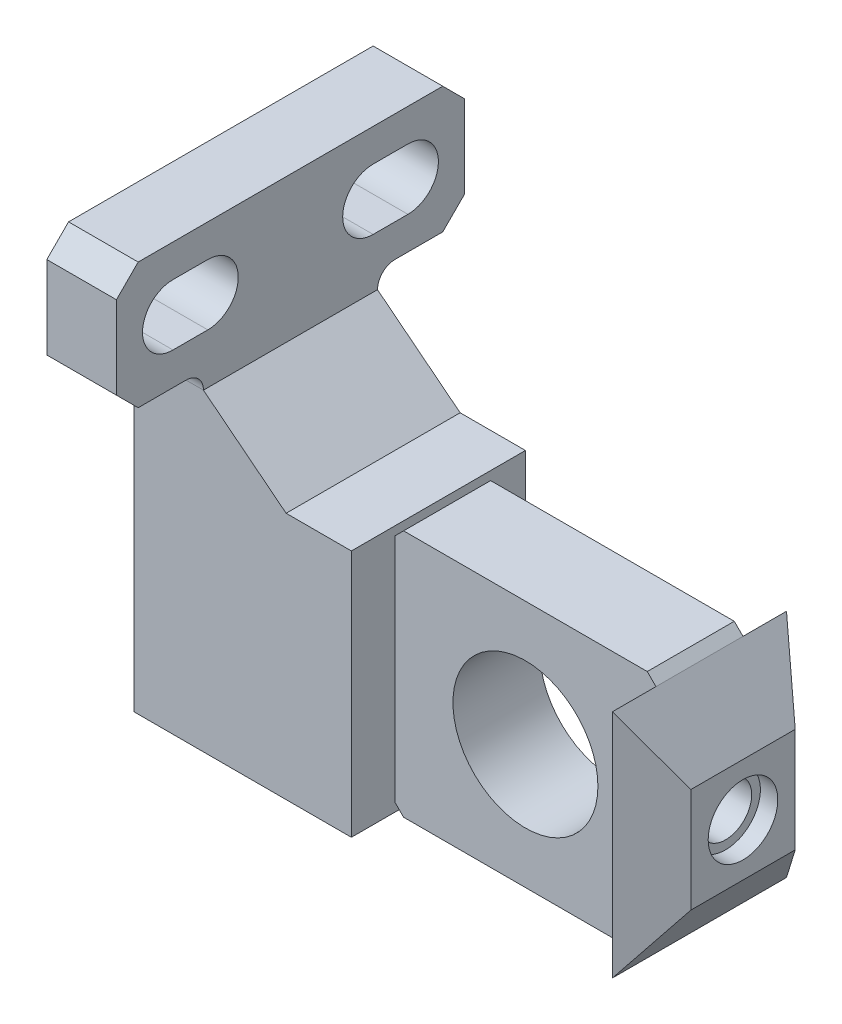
from build123d import *

# Parameters (mm, degrees)
EXTRUDE_1_DEPTH          = 5
EXTRUDE_1_DEPTH_BACK     = 5
SKETCH_2_W               = 10
SKETCH_2_H               = 8.331
EXTRUDE_2_DEPTH          = 10
EXTRUDE_2_DEPTH_BACK     = 10
CUT_EXTRUDE_1_DEPTH      = 13.25
CUT_EXTRUDE_1_DEPTH_BACK = 13.25
EXTRUDE_3_DEPTH          = 10
EXTRUDE_3_DEPTH_BACK     = 10
EXTRUDE_4_DEPTH          = 8


with BuildPart() as part:
    # Sketch 1 → Extrude 1 (new, two sides: drawn at the far end of the back side and taken through both)
    with BuildSketch(Plane.XY.offset(-EXTRUDE_1_DEPTH_BACK)):
        Polygon((-15, 13.25), (-15, -13.25), (-14, -14.25), (14, -14.25), (15, -13.25), (15, 13.25), (14, 14.25), (-14, 14.25), align=None)
    extrude(amount=EXTRUDE_1_DEPTH + EXTRUDE_1_DEPTH_BACK)

    # Sketch 2 → Cut-Revolve 1 (revolve, cut)
    with BuildSketch(Plane(origin=(0, 0, 0), x_dir=(0, 0, -1), z_dir=(1, 0, 0)), mode=Mode.PRIVATE) as cut_revolve_1_sk:
        with Locations((0, 4.1655)):
            Rectangle(SKETCH_2_W, SKETCH_2_H)
    revolve(cut_revolve_1_sk.sketch.rotate(Axis((0, 0, -5), (0, 0, 1)), 270), axis=Axis((0, 0, -5), (0, 0, 1)), mode=Mode.SUBTRACT)

    # Sketch 3 → Extrude 2 (add, two sides: drawn at the far end of the back side and taken through both)
    with BuildSketch(Plane.XY.offset(-EXTRUDE_2_DEPTH_BACK)):
        Polygon((15, 13.25), (15, -13.25), (20, -6), (20, 6), align=None)
    extrude(amount=EXTRUDE_2_DEPTH + EXTRUDE_2_DEPTH_BACK)

    # Sketch 4 → Cut-Extrude 1 (cut, two sides: drawn at the far end of the back side and taken through both)
    with BuildSketch(Plane(origin=(0, 0, 0), x_dir=(1, 0, 0), z_dir=(0, 1, 0)).offset(-CUT_EXTRUDE_1_DEPTH_BACK)):
        Polygon((15, -10), (25, -10), (25, 10), (15, 10), (20, 6), (20, -6), align=None)
    extrude(amount=CUT_EXTRUDE_1_DEPTH + CUT_EXTRUDE_1_DEPTH_BACK, mode=Mode.SUBTRACT)

    # Sketch 5 → Cut-Revolve 2 (revolve, cut)
    with BuildSketch(Plane.XY, mode=Mode.PRIVATE) as cut_revolve_2_sk:
        Polygon((12, 0), (12, 3), (18, 3), (18, 4), (20, 4), (20, 0), align=None)
    revolve(cut_revolve_2_sk.sketch.rotate(Axis((20, 0, 0), (-1, 0, 0)), 270), axis=Axis((20, 0, 0), (-1, 0, 0)), mode=Mode.SUBTRACT)

    # Sketch 6 → Extrude 3 (add, two sides: drawn at the far end of the back side and taken through both)
    with BuildSketch(Plane.XY.offset(-EXTRUDE_3_DEPTH_BACK)):
        Polygon((-40, 21.75), (-40, -14.25), (-15, -14.25), (-15, 14.25), (-22.5, 14.25), (-32, 21.75), align=None)
    extrude(amount=EXTRUDE_3_DEPTH + EXTRUDE_3_DEPTH_BACK)

    # Sketch 7 → Extrude 4 (add)
    with BuildSketch(Plane(origin=(-40, 0, 0), x_dir=(0, 0, -1), z_dir=(1, 0, 0))):
        with BuildLine():
            Line((-20, 26.25), (-17.5, 23.75))
            Line((-17.5, 23.75), (-12, 23.75))
            ThreePointArc((-12, 23.75), (-10.585786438, 23.164213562), (-10, 21.75))
            Line((-10, 21.75), (10, 21.75))
            ThreePointArc((10, 21.75), (10.585786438, 23.164213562), (12, 23.75))
            Line((12, 23.75), (17.5, 23.75))
            Line((17.5, 23.75), (20, 26.25))
            Line((20, 26.25), (20, 35.75))
            Line((20, 35.75), (17.5, 38.25))
            Line((17.5, 38.25), (-17.5, 38.25))
            Line((-17.5, 38.25), (-20, 35.75))
            Line((-20, 35.75), (-20, 26.25))
        make_face()
        with BuildLine():
            Line((9.5, 27.5), (13.5, 27.5))
            ThreePointArc((13.5, 27.5), (17, 31), (13.5, 34.5))
            Line((13.5, 34.5), (9.5, 34.5))
            ThreePointArc((9.5, 34.5), (6, 31), (9.5, 27.5))
        make_face(mode=Mode.SUBTRACT)
        with BuildLine():
            Line((-13.5, 27.5), (-9.5, 27.5))
            ThreePointArc((-9.5, 27.5), (-6, 31), (-9.5, 34.5))
            Line((-9.5, 34.5), (-13.5, 34.5))
            ThreePointArc((-13.5, 34.5), (-17, 31), (-13.5, 27.5))
        make_face(mode=Mode.SUBTRACT)
    extrude(amount=EXTRUDE_4_DEPTH)


solid = part.part
